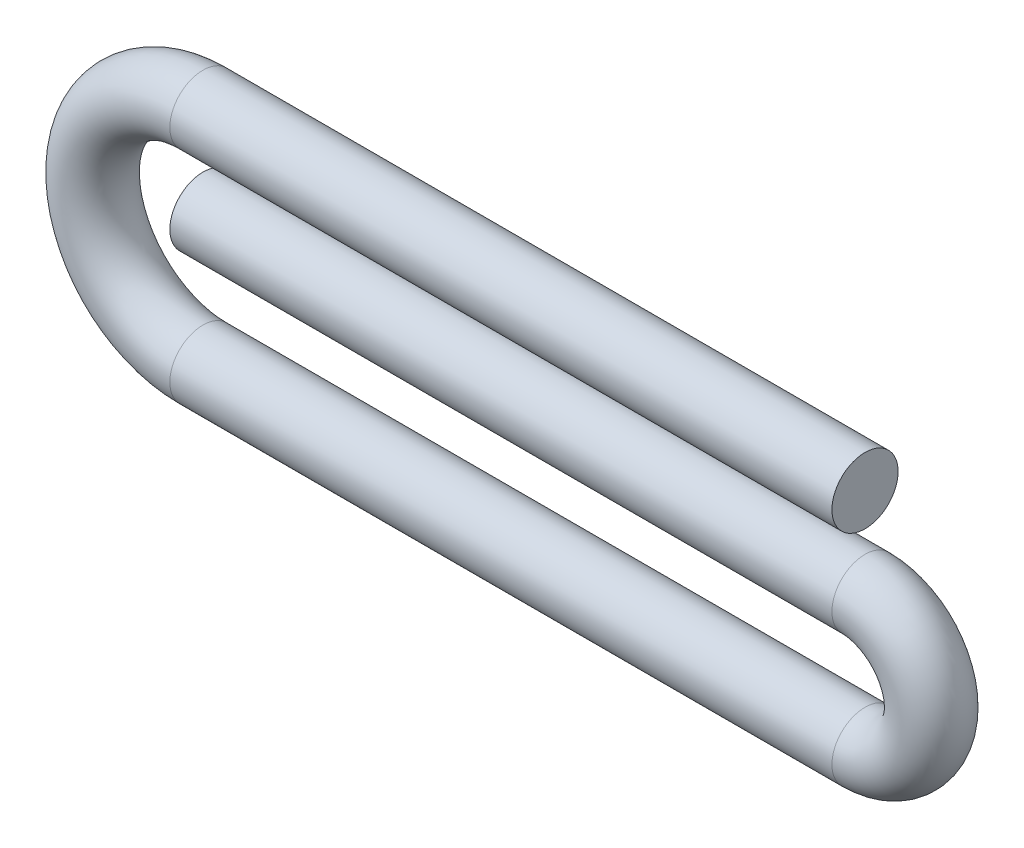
ISO-10303-21;
HEADER;
FILE_DESCRIPTION(('STEP AP214'),'2;1');
FILE_NAME('part.step','',(''),(''),'','','');
FILE_SCHEMA(('AUTOMOTIVE_DESIGN { 1 0 10303 214 1 1 1 1 }'));
ENDSEC;
DATA;
#1=APPLICATION_CONTEXT('core data for automotive mechanical design processes');
#2=APPLICATION_PROTOCOL_DEFINITION('international standard','automotive_design',2000,#1);
#3=PRODUCT_CONTEXT('',#1,'mechanical');
#4=PRODUCT('Part','Part','',(#3));
#5=PRODUCT_RELATED_PRODUCT_CATEGORY('part','',(#4));
#6=PRODUCT_DEFINITION_FORMATION('','',#4);
#7=PRODUCT_DEFINITION_CONTEXT('part definition',#1,'design');
#8=PRODUCT_DEFINITION('design','',#6,#7);
#9=PRODUCT_DEFINITION_SHAPE('','',#8);
#10=(LENGTH_UNIT() NAMED_UNIT(*) SI_UNIT(.MILLI.,.METRE.));
#11=(NAMED_UNIT(*) PLANE_ANGLE_UNIT() SI_UNIT($,.RADIAN.));
#12=(NAMED_UNIT(*) SI_UNIT($,.STERADIAN.) SOLID_ANGLE_UNIT());
#13=UNCERTAINTY_MEASURE_WITH_UNIT(LENGTH_MEASURE(1.E-05),#10,'distance_accuracy_value','');
#14=(GEOMETRIC_REPRESENTATION_CONTEXT(3) GLOBAL_UNCERTAINTY_ASSIGNED_CONTEXT((#13)) GLOBAL_UNIT_ASSIGNED_CONTEXT((#10,
#11,#12)) REPRESENTATION_CONTEXT('',''));
#15=CARTESIAN_POINT('',(0.,0.,0.));
#16=DIRECTION('',(0.,0.,1.));
#17=DIRECTION('',(1.,0.,0.));
#18=AXIS2_PLACEMENT_3D('',#15,#16,#17);
#19=CARTESIAN_POINT('',(0.,4.,0.));
#20=DIRECTION('',(1.,0.,0.));
#21=DIRECTION('',(0.,1.,0.));
#22=AXIS2_PLACEMENT_3D('',#19,#20,#21);
#23=CYLINDRICAL_SURFACE('',#22,1.5);
#24=CARTESIAN_POINT('',(0.,4.,0.));
#25=DIRECTION('',(1.,0.,0.));
#26=DIRECTION('',(0.,0.,-1.));
#27=AXIS2_PLACEMENT_3D('',#24,#25,#26);
#28=CIRCLE('',#27,1.5);
#29=CARTESIAN_POINT('',(0.,5.5,0.));
#30=VERTEX_POINT('',#29);
#31=EDGE_CURVE('E37',#30,#30,#28,.T.);
#32=ORIENTED_EDGE('',*,*,#31,.T.);
#33=EDGE_LOOP('',(#32));
#34=FACE_BOUND('',#33,.T.);
#35=CARTESIAN_POINT('',(30.0000000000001,4.,0.));
#36=DIRECTION('',(1.,0.,0.));
#37=DIRECTION('',(0.,0.,-1.));
#38=AXIS2_PLACEMENT_3D('',#35,#36,#37);
#39=CIRCLE('',#38,1.5);
#40=CARTESIAN_POINT('',(30.0000000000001,4.,-1.5));
#41=VERTEX_POINT('',#40);
#42=EDGE_CURVE('E10',#41,#41,#39,.T.);
#43=ORIENTED_EDGE('',*,*,#42,.F.);
#44=EDGE_LOOP('',(#43));
#45=FACE_BOUND('',#44,.T.);
#46=ADVANCED_FACE('F31',(#34,#45),#23,.T.);
#47=CARTESIAN_POINT('',(0.,-1.,0.));
#48=DIRECTION('',(0.,0.,-1.));
#49=DIRECTION('',(-1.,0.,0.));
#50=AXIS2_PLACEMENT_3D('',#47,#48,#49);
#51=TOROIDAL_SURFACE('',#50,5.,1.5);
#52=CARTESIAN_POINT('',(0.,-6.,0.));
#53=DIRECTION('',(-1.,0.,0.));
#54=DIRECTION('',(0.,0.,-1.));
#55=AXIS2_PLACEMENT_3D('',#52,#53,#54);
#56=CIRCLE('',#55,1.5);
#57=CARTESIAN_POINT('',(0.,-7.5,0.));
#58=VERTEX_POINT('',#57);
#59=EDGE_CURVE('E41',#58,#58,#56,.T.);
#60=CARTESIAN_POINT('',(0.,-1.,0.));
#61=DIRECTION('',(0.,0.,-1.));
#62=DIRECTION('',(-1.,0.,0.));
#63=AXIS2_PLACEMENT_3D('',#60,#61,#62);
#64=CIRCLE('',#63,6.5);
#65=EDGE_CURVE('',#58,#30,#64,.T.);
#66=ORIENTED_EDGE('',*,*,#59,.T.);
#67=ORIENTED_EDGE('',*,*,#31,.F.);
#68=ORIENTED_EDGE('',*,*,#65,.T.);
#69=ORIENTED_EDGE('',*,*,#65,.F.);
#70=EDGE_LOOP('',(#66,#68,#67,#69));
#71=FACE_BOUND('',#70,.T.);
#72=ADVANCED_FACE('F68',(#71),#51,.T.);
#73=CARTESIAN_POINT('',(30.,-6.,0.));
#74=DIRECTION('',(-1.,0.,0.));
#75=DIRECTION('',(0.,-1.,0.));
#76=AXIS2_PLACEMENT_3D('',#73,#74,#75);
#77=CYLINDRICAL_SURFACE('',#76,1.5);
#78=CARTESIAN_POINT('',(30.,-6.,0.));
#79=DIRECTION('',(-1.,0.,0.));
#80=DIRECTION('',(0.,0.,-1.));
#81=AXIS2_PLACEMENT_3D('',#78,#79,#80);
#82=CIRCLE('',#81,1.5);
#83=CARTESIAN_POINT('',(30.,-7.5,0.));
#84=VERTEX_POINT('',#83);
#85=EDGE_CURVE('E45',#84,#84,#82,.T.);
#86=ORIENTED_EDGE('',*,*,#85,.T.);
#87=EDGE_LOOP('',(#86));
#88=FACE_BOUND('',#87,.T.);
#89=ORIENTED_EDGE('',*,*,#59,.F.);
#90=EDGE_LOOP('',(#89));
#91=FACE_BOUND('',#90,.T.);
#92=ADVANCED_FACE('F72',(#88,#91),#77,.T.);
#93=CARTESIAN_POINT('',(30.,-3.,0.));
#94=DIRECTION('',(0.,0.,-1.));
#95=DIRECTION('',(-1.,0.,0.));
#96=AXIS2_PLACEMENT_3D('',#93,#94,#95);
#97=TOROIDAL_SURFACE('',#96,3.,1.5);
#98=CARTESIAN_POINT('',(30.,0.,0.));
#99=DIRECTION('',(1.,0.,0.));
#100=DIRECTION('',(0.,0.,-1.));
#101=AXIS2_PLACEMENT_3D('',#98,#99,#100);
#102=CIRCLE('',#101,1.5);
#103=CARTESIAN_POINT('',(30.,1.5,0.));
#104=VERTEX_POINT('',#103);
#105=EDGE_CURVE('E50',#104,#104,#102,.T.);
#106=CARTESIAN_POINT('',(30.,-3.,0.));
#107=DIRECTION('',(0.,0.,-1.));
#108=DIRECTION('',(-1.,0.,0.));
#109=AXIS2_PLACEMENT_3D('',#106,#107,#108);
#110=CIRCLE('',#109,4.5);
#111=EDGE_CURVE('',#104,#84,#110,.T.);
#112=ORIENTED_EDGE('',*,*,#105,.T.);
#113=ORIENTED_EDGE('',*,*,#85,.F.);
#114=ORIENTED_EDGE('',*,*,#111,.T.);
#115=ORIENTED_EDGE('',*,*,#111,.F.);
#116=EDGE_LOOP('',(#112,#114,#113,#115));
#117=FACE_BOUND('',#116,.T.);
#118=ADVANCED_FACE('F78',(#117),#97,.T.);
#119=CARTESIAN_POINT('',(30.,0.,0.));
#120=DIRECTION('',(-1.,0.,0.));
#121=DIRECTION('',(0.,0.,1.));
#122=AXIS2_PLACEMENT_3D('',#119,#120,#121);
#123=CYLINDRICAL_SURFACE('',#122,1.5);
#124=ORIENTED_EDGE('',*,*,#105,.F.);
#125=EDGE_LOOP('',(#124));
#126=FACE_BOUND('',#125,.T.);
#127=CARTESIAN_POINT('',(0.,0.,0.));
#128=DIRECTION('',(1.,0.,0.));
#129=DIRECTION('',(0.,0.,-1.));
#130=AXIS2_PLACEMENT_3D('',#127,#128,#129);
#131=CIRCLE('',#130,1.5);
#132=CARTESIAN_POINT('',(0.,0.,-1.5));
#133=VERTEX_POINT('',#132);
#134=EDGE_CURVE('E53',#133,#133,#131,.T.);
#135=ORIENTED_EDGE('',*,*,#134,.T.);
#136=EDGE_LOOP('',(#135));
#137=FACE_BOUND('',#136,.T.);
#138=ADVANCED_FACE('F57',(#126,#137),#123,.T.);
#139=CARTESIAN_POINT('',(30.0000000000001,4.,0.));
#140=DIRECTION('',(1.,0.,0.));
#141=DIRECTION('',(0.,0.,-1.));
#142=AXIS2_PLACEMENT_3D('',#139,#140,#141);
#143=PLANE('',#142);
#144=ORIENTED_EDGE('',*,*,#42,.T.);
#145=EDGE_LOOP('',(#144));
#146=FACE_BOUND('',#145,.T.);
#147=ADVANCED_FACE('F61',(#146),#143,.T.);
#148=CARTESIAN_POINT('',(0.,0.,0.));
#149=DIRECTION('',(1.,0.,0.));
#150=DIRECTION('',(0.,0.,-1.));
#151=AXIS2_PLACEMENT_3D('',#148,#149,#150);
#152=PLANE('',#151);
#153=ORIENTED_EDGE('',*,*,#134,.F.);
#154=EDGE_LOOP('',(#153));
#155=FACE_BOUND('',#154,.T.);
#156=ADVANCED_FACE('F59',(#155),#152,.F.);
#157=CLOSED_SHELL('',(#46,#72,#92,#118,#138,#147,#156));
#158=MANIFOLD_SOLID_BREP('B2',#157);
#159=ADVANCED_BREP_SHAPE_REPRESENTATION('',(#18,#158),#14);
#160=SHAPE_DEFINITION_REPRESENTATION(#9,#159);
ENDSEC;
END-ISO-10303-21;
